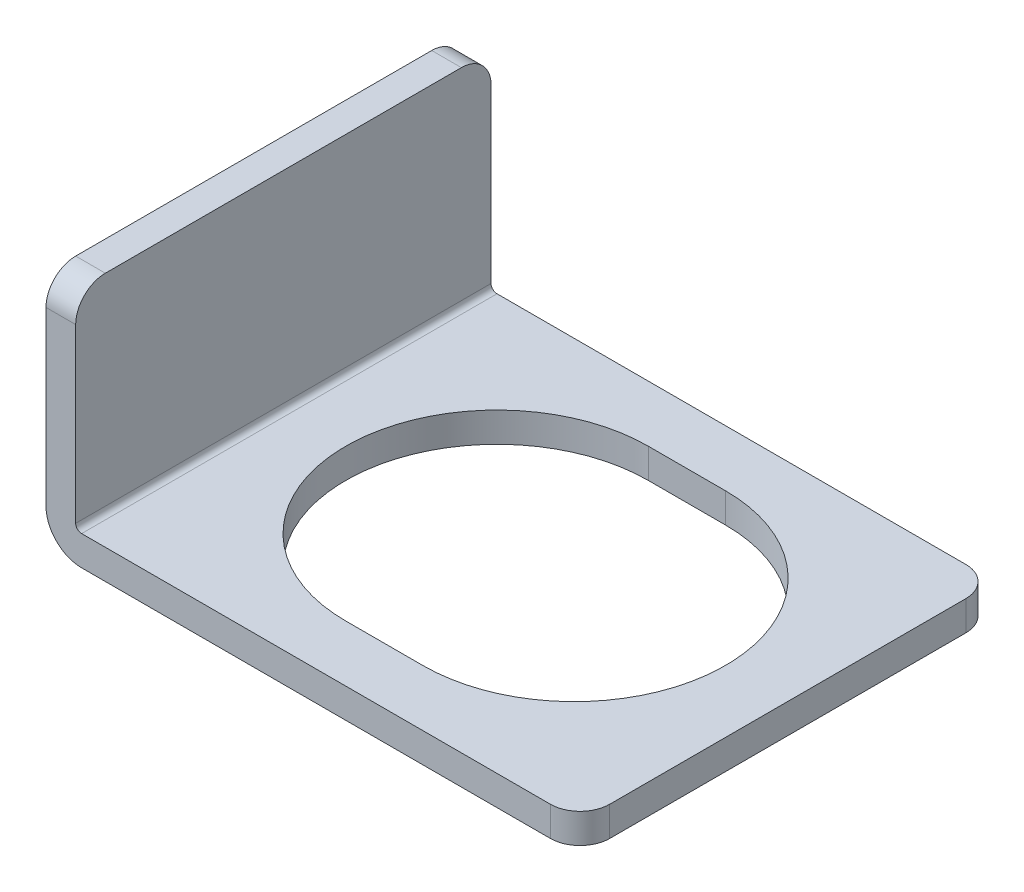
ISO-10303-21;
HEADER;
FILE_DESCRIPTION(('STEP AP214'),'2;1');
FILE_NAME('part.step','',(''),(''),'','','');
FILE_SCHEMA(('AUTOMOTIVE_DESIGN { 1 0 10303 214 1 1 1 1 }'));
ENDSEC;
DATA;
#1=APPLICATION_CONTEXT('core data for automotive mechanical design processes');
#2=APPLICATION_PROTOCOL_DEFINITION('international standard','automotive_design',2000,#1);
#3=PRODUCT_CONTEXT('',#1,'mechanical');
#4=PRODUCT('Part','Part','',(#3));
#5=PRODUCT_RELATED_PRODUCT_CATEGORY('part','',(#4));
#6=PRODUCT_DEFINITION_FORMATION('','',#4);
#7=PRODUCT_DEFINITION_CONTEXT('part definition',#1,'design');
#8=PRODUCT_DEFINITION('design','',#6,#7);
#9=PRODUCT_DEFINITION_SHAPE('','',#8);
#10=(LENGTH_UNIT() NAMED_UNIT(*) SI_UNIT(.MILLI.,.METRE.));
#11=(NAMED_UNIT(*) PLANE_ANGLE_UNIT() SI_UNIT($,.RADIAN.));
#12=(NAMED_UNIT(*) SI_UNIT($,.STERADIAN.) SOLID_ANGLE_UNIT());
#13=UNCERTAINTY_MEASURE_WITH_UNIT(LENGTH_MEASURE(1.E-05),#10,'distance_accuracy_value','');
#14=(GEOMETRIC_REPRESENTATION_CONTEXT(3) GLOBAL_UNCERTAINTY_ASSIGNED_CONTEXT((#13)) GLOBAL_UNIT_ASSIGNED_CONTEXT((#10,
#11,#12)) REPRESENTATION_CONTEXT('',''));
#15=CARTESIAN_POINT('',(0.,0.,0.));
#16=DIRECTION('',(0.,0.,1.));
#17=DIRECTION('',(1.,0.,0.));
#18=AXIS2_PLACEMENT_3D('',#15,#16,#17);
#19=CARTESIAN_POINT('',(0.,8.,7.));
#20=DIRECTION('',(0.,-1.,0.));
#21=DIRECTION('',(0.,0.,-1.));
#22=AXIS2_PLACEMENT_3D('',#19,#20,#21);
#23=PLANE('',#22);
#24=DIRECTION('',(0.,0.,-1.));
#25=VECTOR('',#24,1.);
#26=CARTESIAN_POINT('',(1.,8.,7.));
#27=LINE('',#26,#25);
#28=CARTESIAN_POINT('',(1.,8.,6.));
#29=VERTEX_POINT('',#28);
#30=CARTESIAN_POINT('',(1.,8.,-6.));
#31=VERTEX_POINT('',#30);
#32=EDGE_CURVE('E231',#29,#31,#27,.T.);
#33=ORIENTED_EDGE('',*,*,#32,.T.);
#34=DIRECTION('',(-1.,0.,0.));
#35=VECTOR('',#34,1.);
#36=CARTESIAN_POINT('',(0.,8.,-6.));
#37=LINE('',#36,#35);
#38=CARTESIAN_POINT('',(0.,8.,-6.));
#39=VERTEX_POINT('',#38);
#40=EDGE_CURVE('E284',#31,#39,#37,.T.);
#41=ORIENTED_EDGE('',*,*,#40,.T.);
#42=DIRECTION('',(0.,0.,-1.));
#43=VECTOR('',#42,1.);
#44=CARTESIAN_POINT('',(0.,8.,7.));
#45=LINE('',#44,#43);
#46=CARTESIAN_POINT('',(0.,8.,6.));
#47=VERTEX_POINT('',#46);
#48=EDGE_CURVE('E277',#47,#39,#45,.T.);
#49=ORIENTED_EDGE('',*,*,#48,.F.);
#50=DIRECTION('',(-1.,0.,0.));
#51=VECTOR('',#50,1.);
#52=CARTESIAN_POINT('',(0.,8.,6.));
#53=LINE('',#52,#51);
#54=EDGE_CURVE('E281',#47,#29,#53,.F.);
#55=ORIENTED_EDGE('',*,*,#54,.T.);
#56=EDGE_LOOP('',(#33,#41,#49,#55));
#57=FACE_BOUND('',#56,.T.);
#58=ADVANCED_FACE('F39',(#57),#23,.F.);
#59=CARTESIAN_POINT('',(0.,1.2,7.));
#60=DIRECTION('',(1.,0.,0.));
#61=DIRECTION('',(0.,0.,-1.));
#62=AXIS2_PLACEMENT_3D('',#59,#60,#61);
#63=PLANE('',#62);
#64=ORIENTED_EDGE('',*,*,#48,.T.);
#65=CARTESIAN_POINT('',(0.,7.,-6.));
#66=DIRECTION('',(1.,0.,0.));
#67=DIRECTION('',(0.,0.,-1.));
#68=AXIS2_PLACEMENT_3D('',#65,#66,#67);
#69=CIRCLE('',#68,1.);
#70=CARTESIAN_POINT('',(0.,7.,-7.));
#71=VERTEX_POINT('',#70);
#72=EDGE_CURVE('E291',#39,#71,#69,.F.);
#73=ORIENTED_EDGE('',*,*,#72,.T.);
#74=DIRECTION('',(0.,-1.,0.));
#75=VECTOR('',#74,1.);
#76=CARTESIAN_POINT('',(0.,1.2,-7.));
#77=LINE('',#76,#75);
#78=CARTESIAN_POINT('',(0.,1.2,-7.));
#79=VERTEX_POINT('',#78);
#80=EDGE_CURVE('E205',#71,#79,#77,.T.);
#81=ORIENTED_EDGE('',*,*,#80,.T.);
#82=DIRECTION('',(0.,0.,-1.));
#83=VECTOR('',#82,1.);
#84=CARTESIAN_POINT('',(0.,1.2,7.));
#85=LINE('',#84,#83);
#86=CARTESIAN_POINT('',(0.,1.2,7.));
#87=VERTEX_POINT('',#86);
#88=EDGE_CURVE('E273',#87,#79,#85,.T.);
#89=ORIENTED_EDGE('',*,*,#88,.F.);
#90=DIRECTION('',(0.,-1.,0.));
#91=VECTOR('',#90,1.);
#92=CARTESIAN_POINT('',(0.,1.2,7.));
#93=LINE('',#92,#91);
#94=CARTESIAN_POINT('',(0.,7.,7.));
#95=VERTEX_POINT('',#94);
#96=EDGE_CURVE('E211',#95,#87,#93,.T.);
#97=ORIENTED_EDGE('',*,*,#96,.F.);
#98=CARTESIAN_POINT('',(0.,7.,6.));
#99=DIRECTION('',(1.,0.,0.));
#100=DIRECTION('',(0.,0.,-1.));
#101=AXIS2_PLACEMENT_3D('',#98,#99,#100);
#102=CIRCLE('',#101,1.);
#103=EDGE_CURVE('E288',#95,#47,#102,.F.);
#104=ORIENTED_EDGE('',*,*,#103,.T.);
#105=EDGE_LOOP('',(#64,#73,#81,#89,#97,#104));
#106=FACE_BOUND('',#105,.T.);
#107=ADVANCED_FACE('F332',(#106),#63,.F.);
#108=CARTESIAN_POINT('',(1.2,1.2,7.));
#109=DIRECTION('',(0.,0.,-1.));
#110=DIRECTION('',(-1.,0.,0.));
#111=AXIS2_PLACEMENT_3D('',#108,#109,#110);
#112=CYLINDRICAL_SURFACE('',#111,1.2);
#113=CARTESIAN_POINT('',(1.2,1.2,-7.));
#114=DIRECTION('',(0.,0.,1.));
#115=DIRECTION('',(-1.,0.,0.));
#116=AXIS2_PLACEMENT_3D('',#113,#114,#115);
#117=CIRCLE('',#116,1.2);
#118=CARTESIAN_POINT('',(1.2,0.,-7.));
#119=VERTEX_POINT('',#118);
#120=EDGE_CURVE('E234',#79,#119,#117,.T.);
#121=ORIENTED_EDGE('',*,*,#120,.T.);
#122=DIRECTION('',(0.,0.,-1.));
#123=VECTOR('',#122,1.);
#124=CARTESIAN_POINT('',(1.2,0.,7.));
#125=LINE('',#124,#123);
#126=CARTESIAN_POINT('',(1.2,0.,7.));
#127=VERTEX_POINT('',#126);
#128=EDGE_CURVE('E269',#127,#119,#125,.T.);
#129=ORIENTED_EDGE('',*,*,#128,.F.);
#130=CARTESIAN_POINT('',(1.2,1.2,7.));
#131=DIRECTION('',(0.,0.,1.));
#132=DIRECTION('',(-1.,0.,0.));
#133=AXIS2_PLACEMENT_3D('',#130,#131,#132);
#134=CIRCLE('',#133,1.2);
#135=EDGE_CURVE('E214',#87,#127,#134,.T.);
#136=ORIENTED_EDGE('',*,*,#135,.F.);
#137=ORIENTED_EDGE('',*,*,#88,.T.);
#138=EDGE_LOOP('',(#121,#129,#136,#137));
#139=FACE_BOUND('',#138,.T.);
#140=ADVANCED_FACE('F339',(#139),#112,.T.);
#141=CARTESIAN_POINT('',(1.2,0.,7.));
#142=DIRECTION('',(0.,1.,0.));
#143=DIRECTION('',(0.,0.,1.));
#144=AXIS2_PLACEMENT_3D('',#141,#142,#143);
#145=PLANE('',#144);
#146=DIRECTION('',(-1.,0.,0.));
#147=VECTOR('',#146,1.);
#148=CARTESIAN_POINT('',(8.2,0.,-5.1));
#149=LINE('',#148,#147);
#150=CARTESIAN_POINT('',(10.8,0.,-5.1));
#151=VERTEX_POINT('',#150);
#152=CARTESIAN_POINT('',(8.2,0.,-5.1));
#153=VERTEX_POINT('',#152);
#154=EDGE_CURVE('E168',#151,#153,#149,.T.);
#155=ORIENTED_EDGE('',*,*,#154,.T.);
#156=CARTESIAN_POINT('',(8.2,0.,0.));
#157=DIRECTION('',(0.,1.,0.));
#158=DIRECTION('',(0.,0.,1.));
#159=AXIS2_PLACEMENT_3D('',#156,#157,#158);
#160=CIRCLE('',#159,5.1);
#161=CARTESIAN_POINT('',(8.2,0.,5.1));
#162=VERTEX_POINT('',#161);
#163=EDGE_CURVE('E159',#153,#162,#160,.T.);
#164=ORIENTED_EDGE('',*,*,#163,.T.);
#165=DIRECTION('',(1.,0.,0.));
#166=VECTOR('',#165,1.);
#167=CARTESIAN_POINT('',(8.2,0.,5.1));
#168=LINE('',#167,#166);
#169=CARTESIAN_POINT('',(10.8,0.,5.1));
#170=VERTEX_POINT('',#169);
#171=EDGE_CURVE('E172',#162,#170,#168,.T.);
#172=ORIENTED_EDGE('',*,*,#171,.T.);
#173=CARTESIAN_POINT('',(10.8,0.,0.));
#174=DIRECTION('',(0.,1.,0.));
#175=DIRECTION('',(0.,0.,1.));
#176=AXIS2_PLACEMENT_3D('',#173,#174,#175);
#177=CIRCLE('',#176,5.1);
#178=EDGE_CURVE('E177',#170,#151,#177,.T.);
#179=ORIENTED_EDGE('',*,*,#178,.T.);
#180=EDGE_LOOP('',(#155,#164,#172,#179));
#181=FACE_BOUND('',#180,.T.);
#182=DIRECTION('',(1.,0.,0.));
#183=VECTOR('',#182,1.);
#184=CARTESIAN_POINT('',(1.2,0.,-7.));
#185=LINE('',#184,#183);
#186=CARTESIAN_POINT('',(17.,0.,-7.));
#187=VERTEX_POINT('',#186);
#188=EDGE_CURVE('E237',#119,#187,#185,.T.);
#189=ORIENTED_EDGE('',*,*,#188,.T.);
#190=CARTESIAN_POINT('',(17.,0.,-6.));
#191=DIRECTION('',(0.,1.,0.));
#192=DIRECTION('',(0.,0.,1.));
#193=AXIS2_PLACEMENT_3D('',#190,#191,#192);
#194=CIRCLE('',#193,1.);
#195=CARTESIAN_POINT('',(18.,0.,-6.));
#196=VERTEX_POINT('',#195);
#197=EDGE_CURVE('E319',#187,#196,#194,.F.);
#198=ORIENTED_EDGE('',*,*,#197,.T.);
#199=DIRECTION('',(0.,0.,-1.));
#200=VECTOR('',#199,1.);
#201=CARTESIAN_POINT('',(18.,0.,7.));
#202=LINE('',#201,#200);
#203=CARTESIAN_POINT('',(18.,0.,6.));
#204=VERTEX_POINT('',#203);
#205=EDGE_CURVE('E265',#204,#196,#202,.T.);
#206=ORIENTED_EDGE('',*,*,#205,.F.);
#207=CARTESIAN_POINT('',(17.,0.,6.));
#208=DIRECTION('',(0.,1.,0.));
#209=DIRECTION('',(0.,0.,1.));
#210=AXIS2_PLACEMENT_3D('',#207,#208,#209);
#211=CIRCLE('',#210,1.);
#212=CARTESIAN_POINT('',(17.,0.,7.));
#213=VERTEX_POINT('',#212);
#214=EDGE_CURVE('E55',#204,#213,#211,.F.);
#215=ORIENTED_EDGE('',*,*,#214,.T.);
#216=DIRECTION('',(1.,0.,0.));
#217=VECTOR('',#216,1.);
#218=CARTESIAN_POINT('',(1.2,0.,7.));
#219=LINE('',#218,#217);
#220=EDGE_CURVE('E218',#127,#213,#219,.T.);
#221=ORIENTED_EDGE('',*,*,#220,.F.);
#222=ORIENTED_EDGE('',*,*,#128,.T.);
#223=EDGE_LOOP('',(#189,#198,#206,#215,#221,#222));
#224=FACE_BOUND('',#223,.T.);
#225=ADVANCED_FACE('F179',(#181,#224),#145,.F.);
#226=CARTESIAN_POINT('',(18.,1.,7.));
#227=DIRECTION('',(-1.,0.,0.));
#228=DIRECTION('',(0.,0.,1.));
#229=AXIS2_PLACEMENT_3D('',#226,#227,#228);
#230=PLANE('',#229);
#231=ORIENTED_EDGE('',*,*,#205,.T.);
#232=DIRECTION('',(0.,1.,0.));
#233=VECTOR('',#232,1.);
#234=CARTESIAN_POINT('',(18.,1.,-6.));
#235=LINE('',#234,#233);
#236=CARTESIAN_POINT('',(18.,1.,-6.));
#237=VERTEX_POINT('',#236);
#238=EDGE_CURVE('E308',#196,#237,#235,.T.);
#239=ORIENTED_EDGE('',*,*,#238,.T.);
#240=DIRECTION('',(0.,0.,-1.));
#241=VECTOR('',#240,1.);
#242=CARTESIAN_POINT('',(18.,1.,7.));
#243=LINE('',#242,#241);
#244=CARTESIAN_POINT('',(18.,1.,6.));
#245=VERTEX_POINT('',#244);
#246=EDGE_CURVE('E261',#245,#237,#243,.T.);
#247=ORIENTED_EDGE('',*,*,#246,.F.);
#248=DIRECTION('',(0.,1.,0.));
#249=VECTOR('',#248,1.);
#250=CARTESIAN_POINT('',(18.,1.,6.));
#251=LINE('',#250,#249);
#252=EDGE_CURVE('E305',#245,#204,#251,.F.);
#253=ORIENTED_EDGE('',*,*,#252,.T.);
#254=EDGE_LOOP('',(#231,#239,#247,#253));
#255=FACE_BOUND('',#254,.T.);
#256=ADVANCED_FACE('F344',(#255),#230,.F.);
#257=CARTESIAN_POINT('',(1.2,1.,7.));
#258=DIRECTION('',(0.,-1.,0.));
#259=DIRECTION('',(0.,0.,-1.));
#260=AXIS2_PLACEMENT_3D('',#257,#258,#259);
#261=PLANE('',#260);
#262=DIRECTION('',(1.,0.,0.));
#263=VECTOR('',#262,1.);
#264=CARTESIAN_POINT('',(8.2,1.,5.1));
#265=LINE('',#264,#263);
#266=CARTESIAN_POINT('',(8.2,1.,5.1));
#267=VERTEX_POINT('',#266);
#268=CARTESIAN_POINT('',(10.8,1.,5.1));
#269=VERTEX_POINT('',#268);
#270=EDGE_CURVE('E197',#267,#269,#265,.T.);
#271=ORIENTED_EDGE('',*,*,#270,.F.);
#272=CARTESIAN_POINT('',(8.2,1.,0.));
#273=DIRECTION('',(0.,1.,0.));
#274=DIRECTION('',(0.,0.,1.));
#275=AXIS2_PLACEMENT_3D('',#272,#273,#274);
#276=CIRCLE('',#275,5.1);
#277=CARTESIAN_POINT('',(8.2,1.,-5.1));
#278=VERTEX_POINT('',#277);
#279=EDGE_CURVE('E162',#278,#267,#276,.T.);
#280=ORIENTED_EDGE('',*,*,#279,.F.);
#281=DIRECTION('',(-1.,0.,0.));
#282=VECTOR('',#281,1.);
#283=CARTESIAN_POINT('',(8.2,1.,-5.1));
#284=LINE('',#283,#282);
#285=CARTESIAN_POINT('',(10.8,1.,-5.1));
#286=VERTEX_POINT('',#285);
#287=EDGE_CURVE('E182',#286,#278,#284,.T.);
#288=ORIENTED_EDGE('',*,*,#287,.F.);
#289=CARTESIAN_POINT('',(10.8,1.,0.));
#290=DIRECTION('',(0.,1.,0.));
#291=DIRECTION('',(0.,0.,1.));
#292=AXIS2_PLACEMENT_3D('',#289,#290,#291);
#293=CIRCLE('',#292,5.1);
#294=EDGE_CURVE('E188',#269,#286,#293,.T.);
#295=ORIENTED_EDGE('',*,*,#294,.F.);
#296=EDGE_LOOP('',(#271,#280,#288,#295));
#297=FACE_BOUND('',#296,.T.);
#298=ORIENTED_EDGE('',*,*,#246,.T.);
#299=CARTESIAN_POINT('',(17.,1.,-6.));
#300=DIRECTION('',(0.,-1.,0.));
#301=DIRECTION('',(0.,0.,-1.));
#302=AXIS2_PLACEMENT_3D('',#299,#300,#301);
#303=CIRCLE('',#302,1.);
#304=CARTESIAN_POINT('',(17.,1.,-7.));
#305=VERTEX_POINT('',#304);
#306=EDGE_CURVE('E314',#237,#305,#303,.F.);
#307=ORIENTED_EDGE('',*,*,#306,.T.);
#308=DIRECTION('',(-1.,0.,0.));
#309=VECTOR('',#308,1.);
#310=CARTESIAN_POINT('',(1.2,1.,-7.));
#311=LINE('',#310,#309);
#312=CARTESIAN_POINT('',(1.2,1.,-7.));
#313=VERTEX_POINT('',#312);
#314=EDGE_CURVE('E241',#305,#313,#311,.T.);
#315=ORIENTED_EDGE('',*,*,#314,.T.);
#316=DIRECTION('',(0.,0.,-1.));
#317=VECTOR('',#316,1.);
#318=CARTESIAN_POINT('',(1.2,1.,7.));
#319=LINE('',#318,#317);
#320=CARTESIAN_POINT('',(1.2,1.,7.));
#321=VERTEX_POINT('',#320);
#322=EDGE_CURVE('E257',#321,#313,#319,.T.);
#323=ORIENTED_EDGE('',*,*,#322,.F.);
#324=DIRECTION('',(-1.,0.,0.));
#325=VECTOR('',#324,1.);
#326=CARTESIAN_POINT('',(1.2,1.,7.));
#327=LINE('',#326,#325);
#328=CARTESIAN_POINT('',(17.,1.,7.));
#329=VERTEX_POINT('',#328);
#330=EDGE_CURVE('E221',#329,#321,#327,.T.);
#331=ORIENTED_EDGE('',*,*,#330,.F.);
#332=CARTESIAN_POINT('',(17.,1.,6.));
#333=DIRECTION('',(0.,-1.,0.));
#334=DIRECTION('',(0.,0.,-1.));
#335=AXIS2_PLACEMENT_3D('',#332,#333,#334);
#336=CIRCLE('',#335,1.);
#337=EDGE_CURVE('E63',#329,#245,#336,.F.);
#338=ORIENTED_EDGE('',*,*,#337,.T.);
#339=EDGE_LOOP('',(#298,#307,#315,#323,#331,#338));
#340=FACE_BOUND('',#339,.T.);
#341=ADVANCED_FACE('F352',(#297,#340),#261,.F.);
#342=CARTESIAN_POINT('',(1.2,1.2,7.));
#343=DIRECTION('',(0.,0.,-1.));
#344=DIRECTION('',(-1.,0.,0.));
#345=AXIS2_PLACEMENT_3D('',#342,#343,#344);
#346=CYLINDRICAL_SURFACE('',#345,0.2);
#347=CARTESIAN_POINT('',(1.2,1.2,-7.));
#348=DIRECTION('',(0.,0.,-1.));
#349=DIRECTION('',(-1.,0.,0.));
#350=AXIS2_PLACEMENT_3D('',#347,#348,#349);
#351=CIRCLE('',#350,0.2);
#352=CARTESIAN_POINT('',(1.,1.2,-7.));
#353=VERTEX_POINT('',#352);
#354=EDGE_CURVE('E244',#313,#353,#351,.T.);
#355=ORIENTED_EDGE('',*,*,#354,.T.);
#356=DIRECTION('',(0.,0.,-1.));
#357=VECTOR('',#356,1.);
#358=CARTESIAN_POINT('',(1.,1.2,7.));
#359=LINE('',#358,#357);
#360=CARTESIAN_POINT('',(1.,1.2,7.));
#361=VERTEX_POINT('',#360);
#362=EDGE_CURVE('E253',#361,#353,#359,.T.);
#363=ORIENTED_EDGE('',*,*,#362,.F.);
#364=CARTESIAN_POINT('',(1.2,1.2,7.));
#365=DIRECTION('',(0.,0.,-1.));
#366=DIRECTION('',(-1.,0.,0.));
#367=AXIS2_PLACEMENT_3D('',#364,#365,#366);
#368=CIRCLE('',#367,0.2);
#369=EDGE_CURVE('E224',#321,#361,#368,.T.);
#370=ORIENTED_EDGE('',*,*,#369,.F.);
#371=ORIENTED_EDGE('',*,*,#322,.T.);
#372=EDGE_LOOP('',(#355,#363,#370,#371));
#373=FACE_BOUND('',#372,.T.);
#374=ADVANCED_FACE('F358',(#373),#346,.F.);
#375=CARTESIAN_POINT('',(1.,1.2,7.));
#376=DIRECTION('',(-1.,0.,0.));
#377=DIRECTION('',(0.,0.,1.));
#378=AXIS2_PLACEMENT_3D('',#375,#376,#377);
#379=PLANE('',#378);
#380=DIRECTION('',(0.,1.,0.));
#381=VECTOR('',#380,1.);
#382=CARTESIAN_POINT('',(1.,1.2,-7.));
#383=LINE('',#382,#381);
#384=CARTESIAN_POINT('',(1.,7.,-7.));
#385=VERTEX_POINT('',#384);
#386=EDGE_CURVE('E215',#353,#385,#383,.T.);
#387=ORIENTED_EDGE('',*,*,#386,.T.);
#388=CARTESIAN_POINT('',(1.,7.,-6.));
#389=DIRECTION('',(-1.,0.,0.));
#390=DIRECTION('',(0.,0.,1.));
#391=AXIS2_PLACEMENT_3D('',#388,#389,#390);
#392=CIRCLE('',#391,1.);
#393=EDGE_CURVE('E302',#385,#31,#392,.F.);
#394=ORIENTED_EDGE('',*,*,#393,.T.);
#395=ORIENTED_EDGE('',*,*,#32,.F.);
#396=CARTESIAN_POINT('',(1.,7.,6.));
#397=DIRECTION('',(-1.,0.,0.));
#398=DIRECTION('',(0.,0.,1.));
#399=AXIS2_PLACEMENT_3D('',#396,#397,#398);
#400=CIRCLE('',#399,1.);
#401=CARTESIAN_POINT('',(1.,7.,7.));
#402=VERTEX_POINT('',#401);
#403=EDGE_CURVE('E299',#29,#402,#400,.F.);
#404=ORIENTED_EDGE('',*,*,#403,.T.);
#405=DIRECTION('',(0.,1.,0.));
#406=VECTOR('',#405,1.);
#407=CARTESIAN_POINT('',(1.,1.2,7.));
#408=LINE('',#407,#406);
#409=EDGE_CURVE('E227',#361,#402,#408,.T.);
#410=ORIENTED_EDGE('',*,*,#409,.F.);
#411=ORIENTED_EDGE('',*,*,#362,.T.);
#412=EDGE_LOOP('',(#387,#394,#395,#404,#410,#411));
#413=FACE_BOUND('',#412,.T.);
#414=ADVANCED_FACE('F362',(#413),#379,.F.);
#415=CARTESIAN_POINT('',(1.2,1.2,7.));
#416=DIRECTION('',(0.,0.,-1.));
#417=DIRECTION('',(-1.,0.,0.));
#418=AXIS2_PLACEMENT_3D('',#415,#416,#417);
#419=PLANE('',#418);
#420=ORIENTED_EDGE('',*,*,#220,.T.);
#421=DIRECTION('',(0.,1.,0.));
#422=VECTOR('',#421,1.);
#423=CARTESIAN_POINT('',(17.,1.2,7.));
#424=LINE('',#423,#422);
#425=EDGE_CURVE('E11',#213,#329,#424,.T.);
#426=ORIENTED_EDGE('',*,*,#425,.T.);
#427=ORIENTED_EDGE('',*,*,#330,.T.);
#428=ORIENTED_EDGE('',*,*,#369,.T.);
#429=ORIENTED_EDGE('',*,*,#409,.T.);
#430=DIRECTION('',(-1.,0.,0.));
#431=VECTOR('',#430,1.);
#432=CARTESIAN_POINT('',(1.2,7.,7.));
#433=LINE('',#432,#431);
#434=EDGE_CURVE('E48',#402,#95,#433,.T.);
#435=ORIENTED_EDGE('',*,*,#434,.T.);
#436=ORIENTED_EDGE('',*,*,#96,.T.);
#437=ORIENTED_EDGE('',*,*,#135,.T.);
#438=EDGE_LOOP('',(#420,#426,#427,#428,#429,#435,#436,#437));
#439=FACE_BOUND('',#438,.T.);
#440=ADVANCED_FACE('F326',(#439),#419,.F.);
#441=CARTESIAN_POINT('',(1.2,1.2,-7.));
#442=DIRECTION('',(0.,0.,-1.));
#443=DIRECTION('',(-1.,0.,0.));
#444=AXIS2_PLACEMENT_3D('',#441,#442,#443);
#445=PLANE('',#444);
#446=ORIENTED_EDGE('',*,*,#80,.F.);
#447=DIRECTION('',(-1.,0.,0.));
#448=VECTOR('',#447,1.);
#449=CARTESIAN_POINT('',(1.,7.,-7.));
#450=LINE('',#449,#448);
#451=EDGE_CURVE('E296',#71,#385,#450,.F.);
#452=ORIENTED_EDGE('',*,*,#451,.T.);
#453=ORIENTED_EDGE('',*,*,#386,.F.);
#454=ORIENTED_EDGE('',*,*,#354,.F.);
#455=ORIENTED_EDGE('',*,*,#314,.F.);
#456=DIRECTION('',(0.,1.,0.));
#457=VECTOR('',#456,1.);
#458=CARTESIAN_POINT('',(17.,0.,-7.));
#459=LINE('',#458,#457);
#460=EDGE_CURVE('E293',#305,#187,#459,.F.);
#461=ORIENTED_EDGE('',*,*,#460,.T.);
#462=ORIENTED_EDGE('',*,*,#188,.F.);
#463=ORIENTED_EDGE('',*,*,#120,.F.);
#464=EDGE_LOOP('',(#446,#452,#453,#454,#455,#461,#462,#463));
#465=FACE_BOUND('',#464,.T.);
#466=ADVANCED_FACE('F370',(#465),#445,.T.);
#467=CARTESIAN_POINT('',(8.2,0.,0.));
#468=DIRECTION('',(0.,1.,0.));
#469=DIRECTION('',(0.,0.,1.));
#470=AXIS2_PLACEMENT_3D('',#467,#468,#469);
#471=CYLINDRICAL_SURFACE('',#470,5.1);
#472=ORIENTED_EDGE('',*,*,#279,.T.);
#473=DIRECTION('',(0.,1.,0.));
#474=VECTOR('',#473,1.);
#475=CARTESIAN_POINT('',(8.2,0.,5.1));
#476=LINE('',#475,#474);
#477=EDGE_CURVE('E155',#162,#267,#476,.T.);
#478=ORIENTED_EDGE('',*,*,#477,.F.);
#479=ORIENTED_EDGE('',*,*,#163,.F.);
#480=DIRECTION('',(0.,1.,0.));
#481=VECTOR('',#480,1.);
#482=CARTESIAN_POINT('',(8.2,0.,-5.1));
#483=LINE('',#482,#481);
#484=EDGE_CURVE('E202',#153,#278,#483,.T.);
#485=ORIENTED_EDGE('',*,*,#484,.T.);
#486=EDGE_LOOP('',(#472,#478,#479,#485));
#487=FACE_BOUND('',#486,.T.);
#488=ADVANCED_FACE('F157',(#487),#471,.F.);
#489=CARTESIAN_POINT('',(8.2,0.,-5.1));
#490=DIRECTION('',(0.,0.,-1.));
#491=DIRECTION('',(-1.,0.,0.));
#492=AXIS2_PLACEMENT_3D('',#489,#490,#491);
#493=PLANE('',#492);
#494=ORIENTED_EDGE('',*,*,#287,.T.);
#495=ORIENTED_EDGE('',*,*,#484,.F.);
#496=ORIENTED_EDGE('',*,*,#154,.F.);
#497=DIRECTION('',(0.,1.,0.));
#498=VECTOR('',#497,1.);
#499=CARTESIAN_POINT('',(10.8,0.,-5.1));
#500=LINE('',#499,#498);
#501=EDGE_CURVE('E206',#151,#286,#500,.T.);
#502=ORIENTED_EDGE('',*,*,#501,.T.);
#503=EDGE_LOOP('',(#494,#495,#496,#502));
#504=FACE_BOUND('',#503,.T.);
#505=ADVANCED_FACE('F407',(#504),#493,.F.);
#506=CARTESIAN_POINT('',(10.8,0.,0.));
#507=DIRECTION('',(0.,1.,0.));
#508=DIRECTION('',(0.,0.,1.));
#509=AXIS2_PLACEMENT_3D('',#506,#507,#508);
#510=CYLINDRICAL_SURFACE('',#509,5.1);
#511=ORIENTED_EDGE('',*,*,#294,.T.);
#512=ORIENTED_EDGE('',*,*,#501,.F.);
#513=ORIENTED_EDGE('',*,*,#178,.F.);
#514=DIRECTION('',(0.,1.,0.));
#515=VECTOR('',#514,1.);
#516=CARTESIAN_POINT('',(10.8,0.,5.1));
#517=LINE('',#516,#515);
#518=EDGE_CURVE('E167',#170,#269,#517,.T.);
#519=ORIENTED_EDGE('',*,*,#518,.T.);
#520=EDGE_LOOP('',(#511,#512,#513,#519));
#521=FACE_BOUND('',#520,.T.);
#522=ADVANCED_FACE('F380',(#521),#510,.F.);
#523=CARTESIAN_POINT('',(8.2,0.,5.1));
#524=DIRECTION('',(0.,0.,1.));
#525=DIRECTION('',(1.,0.,0.));
#526=AXIS2_PLACEMENT_3D('',#523,#524,#525);
#527=PLANE('',#526);
#528=ORIENTED_EDGE('',*,*,#270,.T.);
#529=ORIENTED_EDGE('',*,*,#518,.F.);
#530=ORIENTED_EDGE('',*,*,#171,.F.);
#531=ORIENTED_EDGE('',*,*,#477,.T.);
#532=EDGE_LOOP('',(#528,#529,#530,#531));
#533=FACE_BOUND('',#532,.T.);
#534=ADVANCED_FACE('F173',(#533),#527,.F.);
#535=CARTESIAN_POINT('',(0.,7.,-6.));
#536=DIRECTION('',(1.,0.,0.));
#537=DIRECTION('',(0.,0.,-1.));
#538=AXIS2_PLACEMENT_3D('',#535,#536,#537);
#539=CYLINDRICAL_SURFACE('',#538,1.);
#540=ORIENTED_EDGE('',*,*,#393,.F.);
#541=ORIENTED_EDGE('',*,*,#451,.F.);
#542=ORIENTED_EDGE('',*,*,#72,.F.);
#543=ORIENTED_EDGE('',*,*,#40,.F.);
#544=EDGE_LOOP('',(#540,#541,#542,#543));
#545=FACE_BOUND('',#544,.T.);
#546=ADVANCED_FACE('F372',(#545),#539,.T.);
#547=CARTESIAN_POINT('',(17.,1.,-6.));
#548=DIRECTION('',(0.,-1.,0.));
#549=DIRECTION('',(0.,0.,-1.));
#550=AXIS2_PLACEMENT_3D('',#547,#548,#549);
#551=CYLINDRICAL_SURFACE('',#550,1.);
#552=ORIENTED_EDGE('',*,*,#197,.F.);
#553=ORIENTED_EDGE('',*,*,#460,.F.);
#554=ORIENTED_EDGE('',*,*,#306,.F.);
#555=ORIENTED_EDGE('',*,*,#238,.F.);
#556=EDGE_LOOP('',(#552,#553,#554,#555));
#557=FACE_BOUND('',#556,.T.);
#558=ADVANCED_FACE('F350',(#557),#551,.T.);
#559=CARTESIAN_POINT('',(17.,1.2,6.));
#560=DIRECTION('',(0.,1.,0.));
#561=DIRECTION('',(0.,0.,1.));
#562=AXIS2_PLACEMENT_3D('',#559,#560,#561);
#563=CYLINDRICAL_SURFACE('',#562,1.);
#564=ORIENTED_EDGE('',*,*,#214,.F.);
#565=ORIENTED_EDGE('',*,*,#252,.F.);
#566=ORIENTED_EDGE('',*,*,#337,.F.);
#567=ORIENTED_EDGE('',*,*,#425,.F.);
#568=EDGE_LOOP('',(#564,#565,#566,#567));
#569=FACE_BOUND('',#568,.T.);
#570=ADVANCED_FACE('F341',(#569),#563,.T.);
#571=CARTESIAN_POINT('',(1.2,7.,6.));
#572=DIRECTION('',(-1.,0.,0.));
#573=DIRECTION('',(0.,0.,1.));
#574=AXIS2_PLACEMENT_3D('',#571,#572,#573);
#575=CYLINDRICAL_SURFACE('',#574,1.);
#576=ORIENTED_EDGE('',*,*,#403,.F.);
#577=ORIENTED_EDGE('',*,*,#54,.F.);
#578=ORIENTED_EDGE('',*,*,#103,.F.);
#579=ORIENTED_EDGE('',*,*,#434,.F.);
#580=EDGE_LOOP('',(#576,#577,#578,#579));
#581=FACE_BOUND('',#580,.T.);
#582=ADVANCED_FACE('F41',(#581),#575,.T.);
#583=CLOSED_SHELL('',(#58,#107,#140,#225,#256,#341,#374,#414,#440,#466,#488,#505,#522,#534,#546,
#558,#570,#582));
#584=MANIFOLD_SOLID_BREP('B2',#583);
#585=ADVANCED_BREP_SHAPE_REPRESENTATION('',(#18,#584),#14);
#586=SHAPE_DEFINITION_REPRESENTATION(#9,#585);
ENDSEC;
END-ISO-10303-21;
